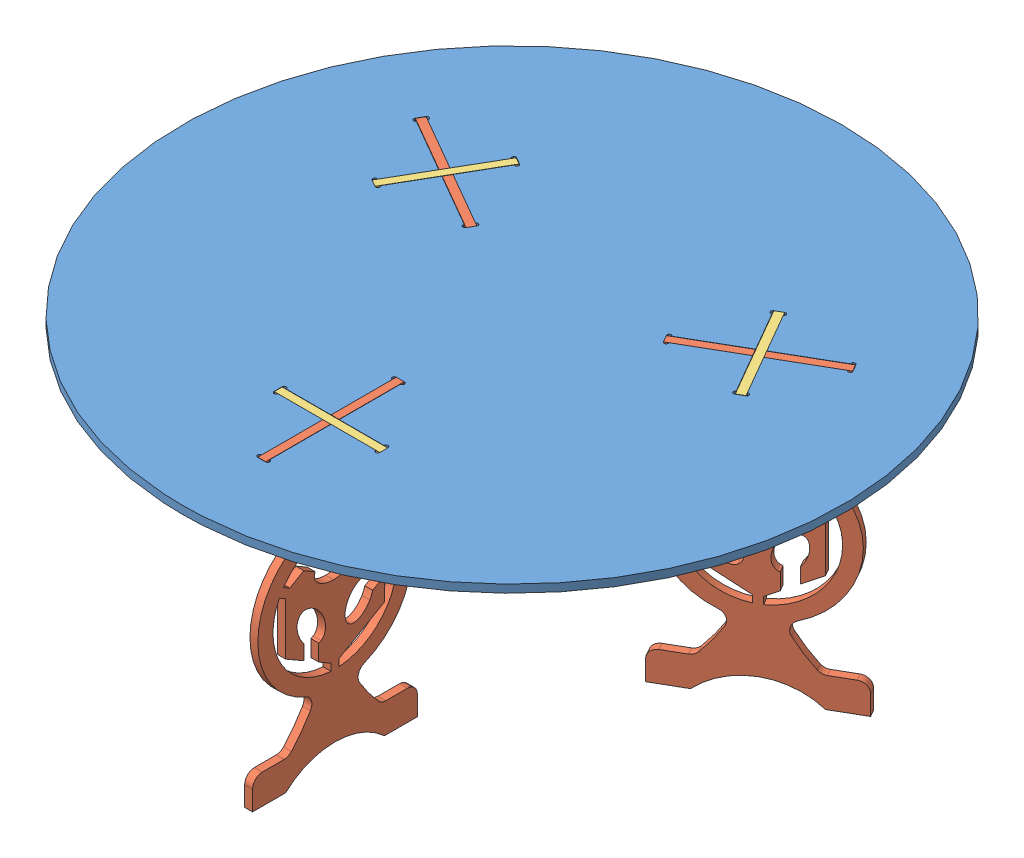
SolidWorks assembly Table.SLDASM, configuration Default (file format 7000). Lengths in mm.
Overall size (1000 1502.58 1000).
7 component instances, 3 part files, 6 mates.
Components (placement in the parent):
- Tabletop-1: Tabletop.sldprt [Default] at origin size (1000 1064.58 1000)
- Table_Leg-1: Table_Leg.sldprt [Default] at (-6.2 -225 274.6) x (0 0 -1) z (1 0 0) size (250 450 12)
- Table_Leg-2: Table_Leg.sldprt [Default] at (240.9106 -225 -131.9306) x (-0.866025 0 0.5) z (-0.5 0 -0.866025) size (250 450 12)
- Table_Leg-3: Table_Leg.sldprt [Default] at (-234.7106 -225 -142.6694) x (0.866025 0 0.5) z (-0.5 0 0.866025) size (250 450 12)
- Crossbrace-1: Crossbrace.sldprt [Default] at (0.2 -44 269) size (200 100 12)
- Crossbrace-2: Crossbrace.sldprt [Default] at (232.8608 -44 -134.6732) x (-0.5 0 -0.866025) z (0.866025 0 -0.5) size (200 100 12)
- Crossbrace-3: Crossbrace.sldprt [Default] at (-233.0608 -44 -134.3268) x (-0.5 0 0.866025) z (-0.866025 0 -0.5) size (200 100 12)
Mates (geometry in assembly coordinates):
- Coincident1: coincident anti-aligned: plane of Tabletop-1 through (0 -6 0) normal (0 -1 0); plane of Table_Leg-1 through (5.8 -6 399.6) normal (0 1 0)
- Coincident5: coincident anti-aligned: plane of Tabletop-1 through (0 -6 169.6) normal (0 0 1); plane of Table_Leg-1 through (5.8 6 169.6) normal (0 0 -1)
- Coincident6: coincident anti-aligned: plane of Tabletop-1 through (-6.2 -6 0) normal (1 0 0); plane of Table_Leg-1 through (-6.2 -524.4674 274.6) normal (-1 0 0)
- Coincident7: coincident anti-aligned: plane of Tabletop-1 through (80.2 -6 0) normal (-1 0 0); plane of Crossbrace-1 through (80.2 6 281) normal (1 0 0)
- Coincident8: coincident anti-aligned: plane of Tabletop-1 through (0 -6 281) normal (0 0 -1); plane of Crossbrace-1 through (-82.8 -6 281) normal (0 0 1)
- Coincident9: coincident anti-aligned: plane of Tabletop-1 through (0 -6 0) normal (0 -1 0); plane of Crossbrace-1 through (-99.8 -6 281) normal (0 1 0)
